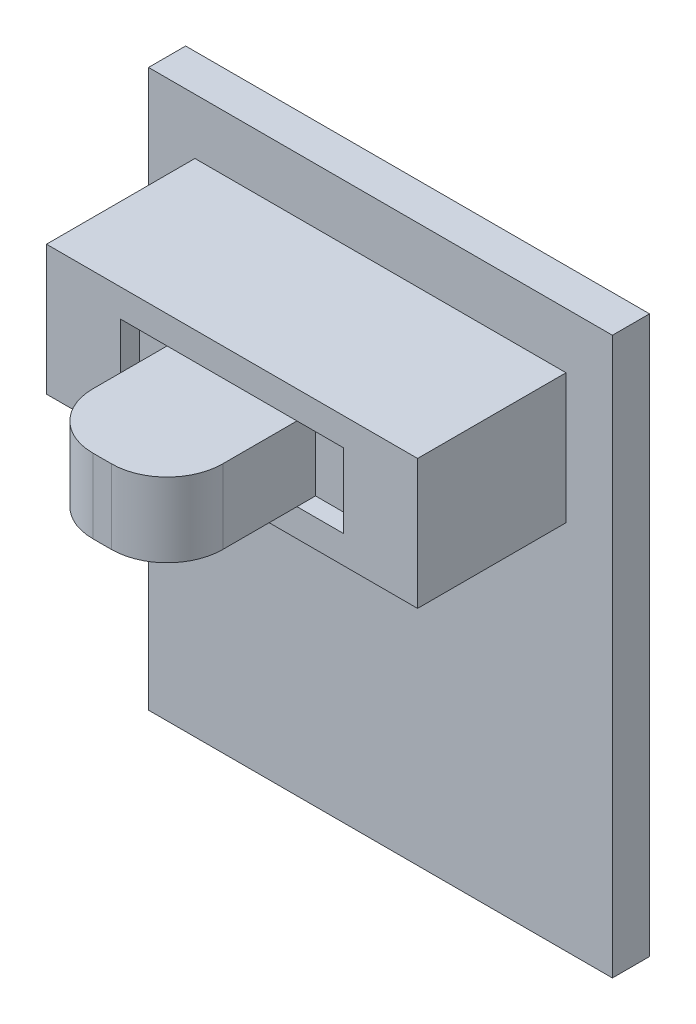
from build123d import *

# Parameters (mm, degrees)
ESQUISSE1_W             = 25
ESQUISSE1_H             = 30
EXTRUSION1_DEPTH        = 2
ESQUISSE2_W             = 20
ESQUISSE2_H             = 7
EXTRUSION2_DEPTH        = 8
ESQUISSE4_W             = 12
ESQUISSE4_H             = 4
ENL_V_MAT_EXTRU_1_DEPTH = 2
ESQUISSE5_W             = 12
ESQUISSE5_H             = 4
EXTRUSION3_DEPTH        = 1
ESQUISSE6_W             = 7
ESQUISSE6_H             = 4
EXTRUSION4_DEPTH        = 8
CONG_1_R                = 3


with BuildPart() as part:
    # Esquisse1 → Extrusion1 (new body)
    with BuildSketch(Plane.XY):
        with Locations((12.5, 15)):
            Rectangle(ESQUISSE1_W, ESQUISSE1_H)
    extrude(amount=EXTRUSION1_DEPTH)

    # Esquisse2 → Extrusion2 (add)
    with BuildSketch(Plane.XY.offset(2)):
        with Locations((12.5, 23.5)):
            Rectangle(ESQUISSE2_W, ESQUISSE2_H)
    extrude(amount=EXTRUSION2_DEPTH)

    # Esquisse4 → Enl_v. mat.-Extru.1 (cut)
    with BuildSketch(Plane.XY.offset(10)):
        with Locations((12.5, 23.5)):
            Rectangle(ESQUISSE4_W, ESQUISSE4_H)
    extrude(amount=-ENL_V_MAT_EXTRU_1_DEPTH, mode=Mode.SUBTRACT)

    # Esquisse5 → Extrusion3 (add)
    with BuildSketch(Plane.XY.offset(8)):
        with Locations((12.5, 23.5)):
            Rectangle(ESQUISSE5_W, ESQUISSE5_H)
    extrude(amount=EXTRUSION3_DEPTH)

    # Esquisse6 → Extrusion4 (add)
    with BuildSketch(Plane.XY.offset(9)):
        with Locations((12.5, 23.5)):
            Rectangle(ESQUISSE6_W, ESQUISSE6_H)
    extrude(amount=EXTRUSION4_DEPTH)

    # Cong_1
    cong_1_edges = [part.edges().sort_by_distance(p)[0] for p in [
        (16, 23.5, 17),
        (9, 23.5, 17),
    ]]
    fillet(cong_1_edges, radius=CONG_1_R)


solid = part.part
